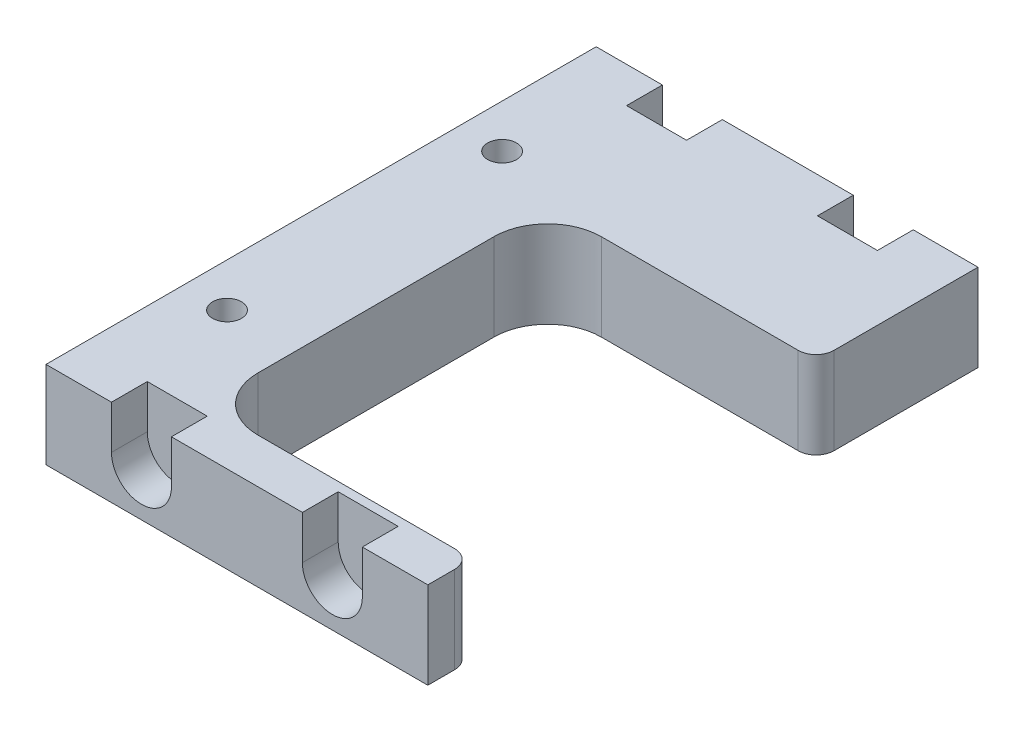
ISO-10303-21;
HEADER;
FILE_DESCRIPTION(('STEP AP214'),'2;1');
FILE_NAME('part.step','',(''),(''),'','','');
FILE_SCHEMA(('AUTOMOTIVE_DESIGN { 1 0 10303 214 1 1 1 1 }'));
ENDSEC;
DATA;
#1=APPLICATION_CONTEXT('core data for automotive mechanical design processes');
#2=APPLICATION_PROTOCOL_DEFINITION('international standard','automotive_design',2000,#1);
#3=PRODUCT_CONTEXT('',#1,'mechanical');
#4=PRODUCT('Part','Part','',(#3));
#5=PRODUCT_RELATED_PRODUCT_CATEGORY('part','',(#4));
#6=PRODUCT_DEFINITION_FORMATION('','',#4);
#7=PRODUCT_DEFINITION_CONTEXT('part definition',#1,'design');
#8=PRODUCT_DEFINITION('design','',#6,#7);
#9=PRODUCT_DEFINITION_SHAPE('','',#8);
#10=(LENGTH_UNIT() NAMED_UNIT(*) SI_UNIT(.MILLI.,.METRE.));
#11=(NAMED_UNIT(*) PLANE_ANGLE_UNIT() SI_UNIT($,.RADIAN.));
#12=(NAMED_UNIT(*) SI_UNIT($,.STERADIAN.) SOLID_ANGLE_UNIT());
#13=UNCERTAINTY_MEASURE_WITH_UNIT(LENGTH_MEASURE(1.E-05),#10,'distance_accuracy_value','');
#14=(GEOMETRIC_REPRESENTATION_CONTEXT(3) GLOBAL_UNCERTAINTY_ASSIGNED_CONTEXT((#13)) GLOBAL_UNIT_ASSIGNED_CONTEXT((#10,
#11,#12)) REPRESENTATION_CONTEXT('',''));
#15=CARTESIAN_POINT('',(0.,0.,0.));
#16=DIRECTION('',(0.,0.,1.));
#17=DIRECTION('',(1.,0.,0.));
#18=AXIS2_PLACEMENT_3D('',#15,#16,#17);
#19=CARTESIAN_POINT('',(-899.286453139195,561.091856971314,0.));
#20=DIRECTION('',(0.,1.,0.));
#21=DIRECTION('',(0.,0.,1.));
#22=AXIS2_PLACEMENT_3D('',#19,#20,#21);
#23=PLANE('',#22);
#24=CARTESIAN_POINT('',(-827.241549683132,561.091856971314,-58.559700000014));
#25=DIRECTION('',(0.,-1.,0.));
#26=DIRECTION('',(0.,0.,-1.));
#27=AXIS2_PLACEMENT_3D('',#24,#25,#26);
#28=CIRCLE('',#27,2.05000000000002);
#29=CARTESIAN_POINT('',(-827.241549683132,561.091856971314,-60.609700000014));
#30=VERTEX_POINT('',#29);
#31=EDGE_CURVE('E401',#30,#30,#28,.T.);
#32=ORIENTED_EDGE('',*,*,#31,.T.);
#33=EDGE_LOOP('',(#32));
#34=FACE_BOUND('',#33,.T.);
#35=CARTESIAN_POINT('',(-827.241549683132,561.091856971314,-19.519900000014));
#36=DIRECTION('',(0.,-1.,0.));
#37=DIRECTION('',(0.,0.,-1.));
#38=AXIS2_PLACEMENT_3D('',#35,#36,#37);
#39=CIRCLE('',#38,2.05000000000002);
#40=CARTESIAN_POINT('',(-827.241549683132,561.091856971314,-21.569900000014));
#41=VERTEX_POINT('',#40);
#42=EDGE_CURVE('E365',#41,#41,#39,.T.);
#43=ORIENTED_EDGE('',*,*,#42,.T.);
#44=EDGE_LOOP('',(#43));
#45=FACE_BOUND('',#44,.T.);
#46=DIRECTION('',(1.,0.,0.));
#47=VECTOR('',#46,1.);
#48=CARTESIAN_POINT('',(-899.286453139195,561.091856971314,0.));
#49=LINE('',#48,#47);
#50=CARTESIAN_POINT('',(-815.612059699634,561.091856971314,0.));
#51=VERTEX_POINT('',#50);
#52=CARTESIAN_POINT('',(-797.026679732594,561.091856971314,0.));
#53=VERTEX_POINT('',#52);
#54=EDGE_CURVE('E480',#51,#53,#49,.T.);
#55=ORIENTED_EDGE('',*,*,#54,.T.);
#56=DIRECTION('',(0.,0.,1.));
#57=VECTOR('',#56,1.);
#58=CARTESIAN_POINT('',(-797.026679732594,561.091856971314,-5.08));
#59=LINE('',#58,#57);
#60=CARTESIAN_POINT('',(-797.026679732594,561.091856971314,-5.08));
#61=VERTEX_POINT('',#60);
#62=EDGE_CURVE('E313',#61,#53,#59,.T.);
#63=ORIENTED_EDGE('',*,*,#62,.F.);
#64=DIRECTION('',(-1.,0.,0.));
#65=VECTOR('',#64,1.);
#66=CARTESIAN_POINT('',(0.,561.091856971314,-5.08));
#67=LINE('',#66,#65);
#68=CARTESIAN_POINT('',(-788.517679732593,561.091856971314,-5.08));
#69=VERTEX_POINT('',#68);
#70=EDGE_CURVE('E290',#69,#61,#67,.T.);
#71=ORIENTED_EDGE('',*,*,#70,.F.);
#72=DIRECTION('',(0.,0.,1.));
#73=VECTOR('',#72,1.);
#74=CARTESIAN_POINT('',(-788.517679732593,561.091856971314,-5.08));
#75=LINE('',#74,#73);
#76=CARTESIAN_POINT('',(-788.517679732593,561.091856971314,0.));
#77=VERTEX_POINT('',#76);
#78=EDGE_CURVE('E285',#69,#77,#75,.T.);
#79=ORIENTED_EDGE('',*,*,#78,.T.);
#80=CARTESIAN_POINT('',(-779.224989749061,561.091856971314,0.));
#81=VERTEX_POINT('',#80);
#82=EDGE_CURVE('E474',#77,#81,#49,.T.);
#83=ORIENTED_EDGE('',*,*,#82,.T.);
#84=DIRECTION('',(0.,0.,1.));
#85=VECTOR('',#84,1.);
#86=CARTESIAN_POINT('',(-779.224989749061,561.091856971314,0.));
#87=LINE('',#86,#85);
#88=CARTESIAN_POINT('',(-779.224989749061,561.091856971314,-3.81));
#89=VERTEX_POINT('',#88);
#90=EDGE_CURVE('E467',#89,#81,#87,.T.);
#91=ORIENTED_EDGE('',*,*,#90,.F.);
#92=CARTESIAN_POINT('',(-781.764989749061,561.091856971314,-3.81));
#93=DIRECTION('',(0.,1.,0.));
#94=DIRECTION('',(0.,0.,1.));
#95=AXIS2_PLACEMENT_3D('',#92,#93,#94);
#96=CIRCLE('',#95,2.54);
#97=CARTESIAN_POINT('',(-781.764989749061,561.091856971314,-6.35));
#98=VERTEX_POINT('',#97);
#99=EDGE_CURVE('E492',#89,#98,#96,.T.);
#100=ORIENTED_EDGE('',*,*,#99,.T.);
#101=DIRECTION('',(1.,0.,0.));
#102=VECTOR('',#101,1.);
#103=CARTESIAN_POINT('',(-899.286453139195,561.091856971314,-6.35));
#104=LINE('',#103,#102);
#105=CARTESIAN_POINT('',(-809.704989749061,561.091856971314,-6.35));
#106=VERTEX_POINT('',#105);
#107=EDGE_CURVE('E452',#106,#98,#104,.T.);
#108=ORIENTED_EDGE('',*,*,#107,.F.);
#109=CARTESIAN_POINT('',(-809.704989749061,561.091856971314,-13.97));
#110=DIRECTION('',(0.,1.,0.));
#111=DIRECTION('',(0.,0.,1.));
#112=AXIS2_PLACEMENT_3D('',#109,#110,#111);
#113=CIRCLE('',#112,7.62);
#114=CARTESIAN_POINT('',(-817.324989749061,561.091856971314,-13.97));
#115=VERTEX_POINT('',#114);
#116=EDGE_CURVE('E488',#106,#115,#113,.F.);
#117=ORIENTED_EDGE('',*,*,#116,.T.);
#118=DIRECTION('',(0.,0.,-1.));
#119=VECTOR('',#118,1.);
#120=CARTESIAN_POINT('',(-817.324989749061,561.091856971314,0.));
#121=LINE('',#120,#119);
#122=CARTESIAN_POINT('',(-817.324989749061,561.091856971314,-47.4833916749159));
#123=VERTEX_POINT('',#122);
#124=EDGE_CURVE('E448',#115,#123,#121,.T.);
#125=ORIENTED_EDGE('',*,*,#124,.T.);
#126=CARTESIAN_POINT('',(-809.704989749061,561.091856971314,-47.4833916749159));
#127=DIRECTION('',(0.,1.,0.));
#128=DIRECTION('',(0.,0.,1.));
#129=AXIS2_PLACEMENT_3D('',#126,#127,#128);
#130=CIRCLE('',#129,7.61999999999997);
#131=CARTESIAN_POINT('',(-809.704989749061,561.091856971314,-55.1033916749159));
#132=VERTEX_POINT('',#131);
#133=EDGE_CURVE('E418',#132,#123,#130,.T.);
#134=ORIENTED_EDGE('',*,*,#133,.F.);
#135=DIRECTION('',(1.,0.,0.));
#136=VECTOR('',#135,1.);
#137=CARTESIAN_POINT('',(0.,561.091856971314,-55.1033916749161));
#138=LINE('',#137,#136);
#139=CARTESIAN_POINT('',(-781.764989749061,561.091856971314,-55.1033916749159));
#140=VERTEX_POINT('',#139);
#141=EDGE_CURVE('E409',#132,#140,#138,.T.);
#142=ORIENTED_EDGE('',*,*,#141,.T.);
#143=CARTESIAN_POINT('',(-781.764989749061,561.091856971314,-57.6433916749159));
#144=DIRECTION('',(0.,1.,0.));
#145=DIRECTION('',(0.,0.,1.));
#146=AXIS2_PLACEMENT_3D('',#143,#144,#145);
#147=CIRCLE('',#146,2.53999999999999);
#148=CARTESIAN_POINT('',(-779.224989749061,561.091856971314,-57.6433916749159));
#149=VERTEX_POINT('',#148);
#150=EDGE_CURVE('E419',#140,#149,#147,.T.);
#151=ORIENTED_EDGE('',*,*,#150,.T.);
#152=CARTESIAN_POINT('',(-779.224989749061,561.091856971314,-78.0796));
#153=VERTEX_POINT('',#152);
#154=EDGE_CURVE('E468',#153,#149,#87,.T.);
#155=ORIENTED_EDGE('',*,*,#154,.F.);
#156=DIRECTION('',(-1.,0.,0.));
#157=VECTOR('',#156,1.);
#158=CARTESIAN_POINT('',(-899.286453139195,561.091856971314,-78.0796));
#159=LINE('',#158,#157);
#160=CARTESIAN_POINT('',(-788.416079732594,561.091856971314,-78.0796));
#161=VERTEX_POINT('',#160);
#162=EDGE_CURVE('E471',#153,#161,#159,.T.);
#163=ORIENTED_EDGE('',*,*,#162,.T.);
#164=DIRECTION('',(0.,0.,-1.));
#165=VECTOR('',#164,1.);
#166=CARTESIAN_POINT('',(-788.416079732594,561.091856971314,-72.9996));
#167=LINE('',#166,#165);
#168=CARTESIAN_POINT('',(-788.416079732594,561.091856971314,-72.9996));
#169=VERTEX_POINT('',#168);
#170=EDGE_CURVE('E366',#169,#161,#167,.T.);
#171=ORIENTED_EDGE('',*,*,#170,.F.);
#172=DIRECTION('',(1.,0.,0.));
#173=VECTOR('',#172,1.);
#174=CARTESIAN_POINT('',(0.,561.091856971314,-72.9996));
#175=LINE('',#174,#173);
#176=CARTESIAN_POINT('',(-796.925079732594,561.091856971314,-72.9996));
#177=VERTEX_POINT('',#176);
#178=EDGE_CURVE('E347',#177,#169,#175,.T.);
#179=ORIENTED_EDGE('',*,*,#178,.F.);
#180=DIRECTION('',(0.,0.,-1.));
#181=VECTOR('',#180,1.);
#182=CARTESIAN_POINT('',(-796.925079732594,561.091856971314,-72.9996));
#183=LINE('',#182,#181);
#184=CARTESIAN_POINT('',(-796.925079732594,561.091856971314,-78.0796));
#185=VERTEX_POINT('',#184);
#186=EDGE_CURVE('E368',#177,#185,#183,.T.);
#187=ORIENTED_EDGE('',*,*,#186,.T.);
#188=CARTESIAN_POINT('',(-815.510459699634,561.091856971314,-78.0796));
#189=VERTEX_POINT('',#188);
#190=EDGE_CURVE('E475',#185,#189,#159,.T.);
#191=ORIENTED_EDGE('',*,*,#190,.T.);
#192=DIRECTION('',(0.,0.,-1.));
#193=VECTOR('',#192,1.);
#194=CARTESIAN_POINT('',(-815.510459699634,561.091856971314,-72.9996));
#195=LINE('',#194,#193);
#196=CARTESIAN_POINT('',(-815.510459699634,561.091856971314,-72.9996));
#197=VERTEX_POINT('',#196);
#198=EDGE_CURVE('E394',#197,#189,#195,.T.);
#199=ORIENTED_EDGE('',*,*,#198,.F.);
#200=DIRECTION('',(1.,0.,0.));
#201=VECTOR('',#200,1.);
#202=CARTESIAN_POINT('',(0.,561.091856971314,-72.9996));
#203=LINE('',#202,#201);
#204=CARTESIAN_POINT('',(-824.019459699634,561.091856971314,-72.9996));
#205=VERTEX_POINT('',#204);
#206=EDGE_CURVE('E379',#205,#197,#203,.T.);
#207=ORIENTED_EDGE('',*,*,#206,.F.);
#208=DIRECTION('',(0.,0.,-1.));
#209=VECTOR('',#208,1.);
#210=CARTESIAN_POINT('',(-824.019459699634,561.091856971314,-72.9996));
#211=LINE('',#210,#209);
#212=CARTESIAN_POINT('',(-824.019459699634,561.091856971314,-78.0796));
#213=VERTEX_POINT('',#212);
#214=EDGE_CURVE('E396',#205,#213,#211,.T.);
#215=ORIENTED_EDGE('',*,*,#214,.T.);
#216=CARTESIAN_POINT('',(-833.413749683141,561.091856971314,-78.0796));
#217=VERTEX_POINT('',#216);
#218=EDGE_CURVE('E470',#213,#217,#159,.T.);
#219=ORIENTED_EDGE('',*,*,#218,.T.);
#220=DIRECTION('',(0.,0.,-1.));
#221=VECTOR('',#220,1.);
#222=CARTESIAN_POINT('',(-833.413749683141,561.091856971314,0.));
#223=LINE('',#222,#221);
#224=CARTESIAN_POINT('',(-833.413749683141,561.091856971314,0.));
#225=VERTEX_POINT('',#224);
#226=EDGE_CURVE('E404',#225,#217,#223,.T.);
#227=ORIENTED_EDGE('',*,*,#226,.F.);
#228=CARTESIAN_POINT('',(-824.121059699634,561.091856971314,0.));
#229=VERTEX_POINT('',#228);
#230=EDGE_CURVE('E476',#225,#229,#49,.T.);
#231=ORIENTED_EDGE('',*,*,#230,.T.);
#232=DIRECTION('',(0.,0.,1.));
#233=VECTOR('',#232,1.);
#234=CARTESIAN_POINT('',(-824.121059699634,561.091856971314,-5.08));
#235=LINE('',#234,#233);
#236=CARTESIAN_POINT('',(-824.121059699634,561.091856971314,-5.08));
#237=VERTEX_POINT('',#236);
#238=EDGE_CURVE('E335',#237,#229,#235,.T.);
#239=ORIENTED_EDGE('',*,*,#238,.F.);
#240=DIRECTION('',(-1.,0.,0.));
#241=VECTOR('',#240,1.);
#242=CARTESIAN_POINT('',(0.,561.091856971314,-5.08));
#243=LINE('',#242,#241);
#244=CARTESIAN_POINT('',(-815.612059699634,561.091856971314,-5.08));
#245=VERTEX_POINT('',#244);
#246=EDGE_CURVE('E322',#245,#237,#243,.T.);
#247=ORIENTED_EDGE('',*,*,#246,.F.);
#248=DIRECTION('',(0.,0.,1.));
#249=VECTOR('',#248,1.);
#250=CARTESIAN_POINT('',(-815.612059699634,561.091856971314,-5.08));
#251=LINE('',#250,#249);
#252=EDGE_CURVE('E337',#245,#51,#251,.T.);
#253=ORIENTED_EDGE('',*,*,#252,.T.);
#254=EDGE_LOOP('',(#55,#63,#71,#79,#83,#91,#100,#108,#117,#125,#134,#142,#151,#155,#163,#171,
#179,#187,#191,#199,#207,#215,#219,#227,#231,#239,#247,#253));
#255=FACE_BOUND('',#254,.T.);
#256=ADVANCED_FACE('F91',(#34,#45,#255),#23,.T.);
#257=CARTESIAN_POINT('',(0.,0.,0.));
#258=DIRECTION('',(0.,0.,1.));
#259=DIRECTION('',(1.,0.,0.));
#260=AXIS2_PLACEMENT_3D('',#257,#258,#259);
#261=PLANE('',#260);
#262=CARTESIAN_POINT('',(-792.772179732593,554.919656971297,0.));
#263=DIRECTION('',(0.,0.,1.));
#264=DIRECTION('',(1.,0.,0.));
#265=AXIS2_PLACEMENT_3D('',#262,#263,#264);
#266=CIRCLE('',#265,4.25450000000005);
#267=CARTESIAN_POINT('',(-788.517679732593,554.919656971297,0.));
#268=VERTEX_POINT('',#267);
#269=CARTESIAN_POINT('',(-797.026679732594,554.919656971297,0.));
#270=VERTEX_POINT('',#269);
#271=EDGE_CURVE('E107',#268,#270,#266,.F.);
#272=ORIENTED_EDGE('',*,*,#271,.T.);
#273=DIRECTION('',(0.,1.,0.));
#274=VECTOR('',#273,1.);
#275=CARTESIAN_POINT('',(-797.026679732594,0.,0.));
#276=LINE('',#275,#274);
#277=EDGE_CURVE('E299',#270,#53,#276,.T.);
#278=ORIENTED_EDGE('',*,*,#277,.T.);
#279=ORIENTED_EDGE('',*,*,#54,.F.);
#280=DIRECTION('',(0.,-1.,0.));
#281=VECTOR('',#280,1.);
#282=CARTESIAN_POINT('',(-815.612059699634,0.,0.));
#283=LINE('',#282,#281);
#284=CARTESIAN_POINT('',(-815.612059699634,554.919656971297,0.));
#285=VERTEX_POINT('',#284);
#286=EDGE_CURVE('E329',#51,#285,#283,.T.);
#287=ORIENTED_EDGE('',*,*,#286,.T.);
#288=CARTESIAN_POINT('',(-819.866559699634,554.919656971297,0.));
#289=DIRECTION('',(0.,0.,1.));
#290=DIRECTION('',(1.,0.,0.));
#291=AXIS2_PLACEMENT_3D('',#288,#289,#290);
#292=CIRCLE('',#291,4.25450000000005);
#293=CARTESIAN_POINT('',(-824.121059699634,554.919656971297,0.));
#294=VERTEX_POINT('',#293);
#295=EDGE_CURVE('E115',#285,#294,#292,.F.);
#296=ORIENTED_EDGE('',*,*,#295,.T.);
#297=DIRECTION('',(0.,1.,0.));
#298=VECTOR('',#297,1.);
#299=CARTESIAN_POINT('',(-824.121059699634,0.,0.));
#300=LINE('',#299,#298);
#301=EDGE_CURVE('E320',#294,#229,#300,.T.);
#302=ORIENTED_EDGE('',*,*,#301,.T.);
#303=ORIENTED_EDGE('',*,*,#230,.F.);
#304=DIRECTION('',(0.,1.,0.));
#305=VECTOR('',#304,1.);
#306=CARTESIAN_POINT('',(-833.413749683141,0.,0.));
#307=LINE('',#306,#305);
#308=CARTESIAN_POINT('',(-833.413749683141,548.747456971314,0.));
#309=VERTEX_POINT('',#308);
#310=EDGE_CURVE('E423',#309,#225,#307,.T.);
#311=ORIENTED_EDGE('',*,*,#310,.F.);
#312=DIRECTION('',(-1.,0.,0.));
#313=VECTOR('',#312,1.);
#314=CARTESIAN_POINT('',(0.,548.747456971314,0.));
#315=LINE('',#314,#313);
#316=CARTESIAN_POINT('',(-779.224989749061,548.747456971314,0.));
#317=VERTEX_POINT('',#316);
#318=EDGE_CURVE('E439',#317,#309,#315,.T.);
#319=ORIENTED_EDGE('',*,*,#318,.F.);
#320=DIRECTION('',(0.,-1.,0.));
#321=VECTOR('',#320,1.);
#322=CARTESIAN_POINT('',(-779.224989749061,0.,0.));
#323=LINE('',#322,#321);
#324=EDGE_CURVE('E456',#81,#317,#323,.T.);
#325=ORIENTED_EDGE('',*,*,#324,.F.);
#326=ORIENTED_EDGE('',*,*,#82,.F.);
#327=DIRECTION('',(0.,-1.,0.));
#328=VECTOR('',#327,1.);
#329=CARTESIAN_POINT('',(-788.517679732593,0.,0.));
#330=LINE('',#329,#328);
#331=EDGE_CURVE('E302',#77,#268,#330,.T.);
#332=ORIENTED_EDGE('',*,*,#331,.T.);
#333=EDGE_LOOP('',(#272,#278,#279,#287,#296,#302,#303,#311,#319,#325,#326,#332));
#334=FACE_BOUND('',#333,.T.);
#335=ADVANCED_FACE('F524',(#334),#261,.T.);
#336=CARTESIAN_POINT('',(0.,0.,-78.0796));
#337=DIRECTION('',(0.,0.,-1.));
#338=DIRECTION('',(-1.,0.,0.));
#339=AXIS2_PLACEMENT_3D('',#336,#337,#338);
#340=PLANE('',#339);
#341=CARTESIAN_POINT('',(-792.670579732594,554.919656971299,-78.0796));
#342=DIRECTION('',(0.,0.,-1.));
#343=DIRECTION('',(-1.,0.,0.));
#344=AXIS2_PLACEMENT_3D('',#341,#342,#343);
#345=CIRCLE('',#344,4.25450000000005);
#346=CARTESIAN_POINT('',(-796.925079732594,554.919656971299,-78.0796));
#347=VERTEX_POINT('',#346);
#348=CARTESIAN_POINT('',(-788.416079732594,554.919656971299,-78.0796));
#349=VERTEX_POINT('',#348);
#350=EDGE_CURVE('E353',#347,#349,#345,.F.);
#351=ORIENTED_EDGE('',*,*,#350,.T.);
#352=DIRECTION('',(0.,1.,0.));
#353=VECTOR('',#352,1.);
#354=CARTESIAN_POINT('',(-788.416079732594,0.,-78.0796));
#355=LINE('',#354,#353);
#356=EDGE_CURVE('E345',#349,#161,#355,.T.);
#357=ORIENTED_EDGE('',*,*,#356,.T.);
#358=ORIENTED_EDGE('',*,*,#162,.F.);
#359=DIRECTION('',(0.,-1.,0.));
#360=VECTOR('',#359,1.);
#361=CARTESIAN_POINT('',(-779.224989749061,562.158656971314,-78.0796));
#362=LINE('',#361,#360);
#363=CARTESIAN_POINT('',(-779.224989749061,548.747456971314,-78.0796));
#364=VERTEX_POINT('',#363);
#365=EDGE_CURVE('E455',#153,#364,#362,.T.);
#366=ORIENTED_EDGE('',*,*,#365,.T.);
#367=DIRECTION('',(1.,0.,0.));
#368=VECTOR('',#367,1.);
#369=CARTESIAN_POINT('',(0.,548.747456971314,-78.0796));
#370=LINE('',#369,#368);
#371=CARTESIAN_POINT('',(-833.413749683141,548.747456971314,-78.0796));
#372=VERTEX_POINT('',#371);
#373=EDGE_CURVE('E438',#372,#364,#370,.T.);
#374=ORIENTED_EDGE('',*,*,#373,.F.);
#375=DIRECTION('',(0.,-1.,0.));
#376=VECTOR('',#375,1.);
#377=CARTESIAN_POINT('',(-833.413749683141,0.,-78.0796));
#378=LINE('',#377,#376);
#379=EDGE_CURVE('E435',#217,#372,#378,.T.);
#380=ORIENTED_EDGE('',*,*,#379,.F.);
#381=ORIENTED_EDGE('',*,*,#218,.F.);
#382=DIRECTION('',(0.,-1.,0.));
#383=VECTOR('',#382,1.);
#384=CARTESIAN_POINT('',(-824.019459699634,0.,-78.0796));
#385=LINE('',#384,#383);
#386=CARTESIAN_POINT('',(-824.019459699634,554.919656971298,-78.0796));
#387=VERTEX_POINT('',#386);
#388=EDGE_CURVE('E387',#213,#387,#385,.T.);
#389=ORIENTED_EDGE('',*,*,#388,.T.);
#390=CARTESIAN_POINT('',(-819.764959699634,554.919656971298,-78.0796));
#391=DIRECTION('',(0.,0.,-1.));
#392=DIRECTION('',(-1.,0.,0.));
#393=AXIS2_PLACEMENT_3D('',#390,#391,#392);
#394=CIRCLE('',#393,4.25450000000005);
#395=CARTESIAN_POINT('',(-815.510459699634,554.919656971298,-78.0796));
#396=VERTEX_POINT('',#395);
#397=EDGE_CURVE('E312',#387,#396,#394,.F.);
#398=ORIENTED_EDGE('',*,*,#397,.T.);
#399=DIRECTION('',(0.,1.,0.));
#400=VECTOR('',#399,1.);
#401=CARTESIAN_POINT('',(-815.510459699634,0.,-78.0796));
#402=LINE('',#401,#400);
#403=EDGE_CURVE('E377',#396,#189,#402,.T.);
#404=ORIENTED_EDGE('',*,*,#403,.T.);
#405=ORIENTED_EDGE('',*,*,#190,.F.);
#406=DIRECTION('',(0.,-1.,0.));
#407=VECTOR('',#406,1.);
#408=CARTESIAN_POINT('',(-796.925079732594,0.,-78.0796));
#409=LINE('',#408,#407);
#410=EDGE_CURVE('E356',#185,#347,#409,.T.);
#411=ORIENTED_EDGE('',*,*,#410,.T.);
#412=EDGE_LOOP('',(#351,#357,#358,#366,#374,#380,#381,#389,#398,#404,#405,#411));
#413=FACE_BOUND('',#412,.T.);
#414=ADVANCED_FACE('F585',(#413),#340,.T.);
#415=CARTESIAN_POINT('',(-817.324989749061,637.016869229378,0.));
#416=DIRECTION('',(1.,0.,0.));
#417=DIRECTION('',(0.,0.,-1.));
#418=AXIS2_PLACEMENT_3D('',#415,#416,#417);
#419=PLANE('',#418);
#420=DIRECTION('',(0.,0.,1.));
#421=VECTOR('',#420,1.);
#422=CARTESIAN_POINT('',(-817.324989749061,548.747456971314,0.));
#423=LINE('',#422,#421);
#424=CARTESIAN_POINT('',(-817.324989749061,548.747456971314,-47.4833916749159));
#425=VERTEX_POINT('',#424);
#426=CARTESIAN_POINT('',(-817.324989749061,548.747456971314,-13.97));
#427=VERTEX_POINT('',#426);
#428=EDGE_CURVE('E446',#425,#427,#423,.T.);
#429=ORIENTED_EDGE('',*,*,#428,.F.);
#430=DIRECTION('',(0.,-1.,0.));
#431=VECTOR('',#430,1.);
#432=CARTESIAN_POINT('',(-817.324989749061,607.665572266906,-47.4833916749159));
#433=LINE('',#432,#431);
#434=EDGE_CURVE('E425',#123,#425,#433,.T.);
#435=ORIENTED_EDGE('',*,*,#434,.F.);
#436=ORIENTED_EDGE('',*,*,#124,.F.);
#437=DIRECTION('',(0.,-1.,0.));
#438=VECTOR('',#437,1.);
#439=CARTESIAN_POINT('',(-817.324989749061,637.016869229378,-13.97));
#440=LINE('',#439,#438);
#441=EDGE_CURVE('E479',#115,#427,#440,.T.);
#442=ORIENTED_EDGE('',*,*,#441,.T.);
#443=EDGE_LOOP('',(#429,#435,#436,#442));
#444=FACE_BOUND('',#443,.T.);
#445=ADVANCED_FACE('F564',(#444),#419,.T.);
#446=CARTESIAN_POINT('',(-833.413749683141,0.,0.));
#447=DIRECTION('',(-1.,0.,0.));
#448=DIRECTION('',(0.,0.,1.));
#449=AXIS2_PLACEMENT_3D('',#446,#447,#448);
#450=PLANE('',#449);
#451=ORIENTED_EDGE('',*,*,#310,.T.);
#452=ORIENTED_EDGE('',*,*,#226,.T.);
#453=ORIENTED_EDGE('',*,*,#379,.T.);
#454=DIRECTION('',(0.,0.,1.));
#455=VECTOR('',#454,1.);
#456=CARTESIAN_POINT('',(-833.413749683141,548.747456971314,-84.4296));
#457=LINE('',#456,#455);
#458=EDGE_CURVE('E459',#372,#309,#457,.T.);
#459=ORIENTED_EDGE('',*,*,#458,.T.);
#460=EDGE_LOOP('',(#451,#452,#453,#459));
#461=FACE_BOUND('',#460,.T.);
#462=ADVANCED_FACE('F588',(#461),#450,.T.);
#463=CARTESIAN_POINT('',(0.,548.747456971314,0.));
#464=DIRECTION('',(0.,-1.,0.));
#465=DIRECTION('',(0.,0.,-1.));
#466=AXIS2_PLACEMENT_3D('',#463,#464,#465);
#467=PLANE('',#466);
#468=CARTESIAN_POINT('',(-827.241549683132,548.747456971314,-58.559700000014));
#469=DIRECTION('',(0.,-1.,0.));
#470=DIRECTION('',(0.,0.,-1.));
#471=AXIS2_PLACEMENT_3D('',#468,#469,#470);
#472=CIRCLE('',#471,3.31999999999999);
#473=CARTESIAN_POINT('',(-827.241549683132,548.747456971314,-61.8797000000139));
#474=VERTEX_POINT('',#473);
#475=EDGE_CURVE('E100',#474,#474,#472,.F.);
#476=ORIENTED_EDGE('',*,*,#475,.T.);
#477=EDGE_LOOP('',(#476));
#478=FACE_BOUND('',#477,.T.);
#479=CARTESIAN_POINT('',(-827.241549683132,548.747456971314,-19.519900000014));
#480=DIRECTION('',(0.,-1.,0.));
#481=DIRECTION('',(0.,0.,-1.));
#482=AXIS2_PLACEMENT_3D('',#479,#480,#481);
#483=CIRCLE('',#482,3.31999999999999);
#484=CARTESIAN_POINT('',(-827.241549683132,548.747456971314,-22.8399000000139));
#485=VERTEX_POINT('',#484);
#486=EDGE_CURVE('E502',#485,#485,#483,.F.);
#487=ORIENTED_EDGE('',*,*,#486,.T.);
#488=EDGE_LOOP('',(#487));
#489=FACE_BOUND('',#488,.T.);
#490=CARTESIAN_POINT('',(-809.704989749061,548.747456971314,-47.4833916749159));
#491=DIRECTION('',(0.,-1.,0.));
#492=DIRECTION('',(0.,0.,-1.));
#493=AXIS2_PLACEMENT_3D('',#490,#491,#492);
#494=CIRCLE('',#493,7.61999999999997);
#495=CARTESIAN_POINT('',(-809.704989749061,548.747456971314,-55.1033916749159));
#496=VERTEX_POINT('',#495);
#497=EDGE_CURVE('E415',#496,#425,#494,.F.);
#498=ORIENTED_EDGE('',*,*,#497,.T.);
#499=ORIENTED_EDGE('',*,*,#428,.T.);
#500=CARTESIAN_POINT('',(-809.704989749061,548.747456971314,-13.97));
#501=DIRECTION('',(0.,-1.,0.));
#502=DIRECTION('',(0.,0.,-1.));
#503=AXIS2_PLACEMENT_3D('',#500,#501,#502);
#504=CIRCLE('',#503,7.62);
#505=CARTESIAN_POINT('',(-809.704989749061,548.747456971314,-6.35));
#506=VERTEX_POINT('',#505);
#507=EDGE_CURVE('E485',#427,#506,#504,.F.);
#508=ORIENTED_EDGE('',*,*,#507,.T.);
#509=DIRECTION('',(-1.,0.,0.));
#510=VECTOR('',#509,1.);
#511=CARTESIAN_POINT('',(0.,548.747456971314,-6.35));
#512=LINE('',#511,#510);
#513=CARTESIAN_POINT('',(-781.764989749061,548.747456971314,-6.35));
#514=VERTEX_POINT('',#513);
#515=EDGE_CURVE('E442',#514,#506,#512,.T.);
#516=ORIENTED_EDGE('',*,*,#515,.F.);
#517=CARTESIAN_POINT('',(-781.764989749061,548.747456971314,-3.81));
#518=DIRECTION('',(0.,-1.,0.));
#519=DIRECTION('',(0.,0.,-1.));
#520=AXIS2_PLACEMENT_3D('',#517,#518,#519);
#521=CIRCLE('',#520,2.54);
#522=CARTESIAN_POINT('',(-779.224989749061,548.747456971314,-3.80999999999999));
#523=VERTEX_POINT('',#522);
#524=EDGE_CURVE('E490',#514,#523,#521,.T.);
#525=ORIENTED_EDGE('',*,*,#524,.T.);
#526=DIRECTION('',(0.,0.,1.));
#527=VECTOR('',#526,1.);
#528=CARTESIAN_POINT('',(-779.224989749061,548.747456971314,-84.4296));
#529=LINE('',#528,#527);
#530=EDGE_CURVE('E464',#523,#317,#529,.T.);
#531=ORIENTED_EDGE('',*,*,#530,.T.);
#532=ORIENTED_EDGE('',*,*,#318,.T.);
#533=ORIENTED_EDGE('',*,*,#458,.F.);
#534=ORIENTED_EDGE('',*,*,#373,.T.);
#535=CARTESIAN_POINT('',(-779.224989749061,548.747456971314,-57.6433916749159));
#536=VERTEX_POINT('',#535);
#537=EDGE_CURVE('E465',#364,#536,#529,.T.);
#538=ORIENTED_EDGE('',*,*,#537,.T.);
#539=CARTESIAN_POINT('',(-781.764989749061,548.747456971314,-57.6433916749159));
#540=DIRECTION('',(0.,-1.,0.));
#541=DIRECTION('',(0.,0.,-1.));
#542=AXIS2_PLACEMENT_3D('',#539,#540,#541);
#543=CIRCLE('',#542,2.53999999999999);
#544=CARTESIAN_POINT('',(-781.764989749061,548.747456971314,-55.1033916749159));
#545=VERTEX_POINT('',#544);
#546=EDGE_CURVE('E410',#545,#536,#543,.F.);
#547=ORIENTED_EDGE('',*,*,#546,.F.);
#548=DIRECTION('',(1.,0.,0.));
#549=VECTOR('',#548,1.);
#550=CARTESIAN_POINT('',(0.,548.747456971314,-55.1033916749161));
#551=LINE('',#550,#549);
#552=EDGE_CURVE('E420',#496,#545,#551,.T.);
#553=ORIENTED_EDGE('',*,*,#552,.F.);
#554=EDGE_LOOP('',(#498,#499,#508,#516,#525,#531,#532,#533,#534,#538,#547,#553));
#555=FACE_BOUND('',#554,.T.);
#556=ADVANCED_FACE('F507',(#478,#489,#555),#467,.T.);
#557=CARTESIAN_POINT('',(-779.224989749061,0.,6.35));
#558=DIRECTION('',(1.,0.,0.));
#559=DIRECTION('',(0.,0.,-1.));
#560=AXIS2_PLACEMENT_3D('',#557,#558,#559);
#561=PLANE('',#560);
#562=ORIENTED_EDGE('',*,*,#324,.T.);
#563=ORIENTED_EDGE('',*,*,#530,.F.);
#564=DIRECTION('',(0.,-1.,0.));
#565=VECTOR('',#564,1.);
#566=CARTESIAN_POINT('',(-779.224989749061,561.091856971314,-3.81));
#567=LINE('',#566,#565);
#568=EDGE_CURVE('E497',#523,#89,#567,.F.);
#569=ORIENTED_EDGE('',*,*,#568,.T.);
#570=ORIENTED_EDGE('',*,*,#90,.T.);
#571=EDGE_LOOP('',(#562,#563,#569,#570));
#572=FACE_BOUND('',#571,.T.);
#573=ADVANCED_FACE('F539',(#572),#561,.T.);
#574=ORIENTED_EDGE('',*,*,#537,.F.);
#575=ORIENTED_EDGE('',*,*,#365,.F.);
#576=ORIENTED_EDGE('',*,*,#154,.T.);
#577=DIRECTION('',(0.,-1.,0.));
#578=VECTOR('',#577,1.);
#579=CARTESIAN_POINT('',(-779.224989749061,607.665572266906,-57.6433916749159));
#580=LINE('',#579,#578);
#581=EDGE_CURVE('E430',#149,#536,#580,.T.);
#582=ORIENTED_EDGE('',*,*,#581,.T.);
#583=EDGE_LOOP('',(#574,#575,#576,#582));
#584=FACE_BOUND('',#583,.T.);
#585=ADVANCED_FACE('F582',(#584),#561,.T.);
#586=CARTESIAN_POINT('',(0.,637.016869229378,-6.35));
#587=DIRECTION('',(0.,0.,1.));
#588=DIRECTION('',(1.,0.,0.));
#589=AXIS2_PLACEMENT_3D('',#586,#587,#588);
#590=PLANE('',#589);
#591=ORIENTED_EDGE('',*,*,#107,.T.);
#592=DIRECTION('',(0.,-1.,0.));
#593=VECTOR('',#592,1.);
#594=CARTESIAN_POINT('',(-781.764989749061,548.747456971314,-6.35));
#595=LINE('',#594,#593);
#596=EDGE_CURVE('E494',#98,#514,#595,.T.);
#597=ORIENTED_EDGE('',*,*,#596,.T.);
#598=ORIENTED_EDGE('',*,*,#515,.T.);
#599=DIRECTION('',(0.,-1.,0.));
#600=VECTOR('',#599,1.);
#601=CARTESIAN_POINT('',(-809.704989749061,637.016869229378,-6.35));
#602=LINE('',#601,#600);
#603=EDGE_CURVE('E483',#506,#106,#602,.F.);
#604=ORIENTED_EDGE('',*,*,#603,.T.);
#605=EDGE_LOOP('',(#591,#597,#598,#604));
#606=FACE_BOUND('',#605,.T.);
#607=ADVANCED_FACE('F554',(#606),#590,.F.);
#608=CARTESIAN_POINT('',(-809.704989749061,637.016869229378,-13.97));
#609=DIRECTION('',(0.,-1.,0.));
#610=DIRECTION('',(0.,0.,-1.));
#611=AXIS2_PLACEMENT_3D('',#608,#609,#610);
#612=CYLINDRICAL_SURFACE('',#611,7.62);
#613=ORIENTED_EDGE('',*,*,#116,.F.);
#614=ORIENTED_EDGE('',*,*,#603,.F.);
#615=ORIENTED_EDGE('',*,*,#507,.F.);
#616=ORIENTED_EDGE('',*,*,#441,.F.);
#617=EDGE_LOOP('',(#613,#614,#615,#616));
#618=FACE_BOUND('',#617,.T.);
#619=ADVANCED_FACE('F558',(#618),#612,.F.);
#620=CARTESIAN_POINT('',(-781.764989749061,637.016869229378,-3.81));
#621=DIRECTION('',(0.,1.,0.));
#622=DIRECTION('',(0.,0.,1.));
#623=AXIS2_PLACEMENT_3D('',#620,#621,#622);
#624=CYLINDRICAL_SURFACE('',#623,2.54);
#625=ORIENTED_EDGE('',*,*,#99,.F.);
#626=ORIENTED_EDGE('',*,*,#568,.F.);
#627=ORIENTED_EDGE('',*,*,#524,.F.);
#628=ORIENTED_EDGE('',*,*,#596,.F.);
#629=EDGE_LOOP('',(#625,#626,#627,#628));
#630=FACE_BOUND('',#629,.T.);
#631=ADVANCED_FACE('F549',(#630),#624,.T.);
#632=CARTESIAN_POINT('',(-809.704989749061,607.665572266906,-47.4833916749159));
#633=DIRECTION('',(0.,-1.,0.));
#634=DIRECTION('',(0.,0.,-1.));
#635=AXIS2_PLACEMENT_3D('',#632,#633,#634);
#636=CYLINDRICAL_SURFACE('',#635,7.61999999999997);
#637=DIRECTION('',(0.,-1.,0.));
#638=VECTOR('',#637,1.);
#639=CARTESIAN_POINT('',(-809.704989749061,607.665572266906,-55.1033916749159));
#640=LINE('',#639,#638);
#641=EDGE_CURVE('E413',#132,#496,#640,.T.);
#642=ORIENTED_EDGE('',*,*,#641,.F.);
#643=ORIENTED_EDGE('',*,*,#133,.T.);
#644=ORIENTED_EDGE('',*,*,#434,.T.);
#645=ORIENTED_EDGE('',*,*,#497,.F.);
#646=EDGE_LOOP('',(#642,#643,#644,#645));
#647=FACE_BOUND('',#646,.T.);
#648=ADVANCED_FACE('F568',(#647),#636,.F.);
#649=CARTESIAN_POINT('',(-781.764989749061,607.665572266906,-57.6433916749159));
#650=DIRECTION('',(0.,-1.,0.));
#651=DIRECTION('',(0.,0.,-1.));
#652=AXIS2_PLACEMENT_3D('',#649,#650,#651);
#653=CYLINDRICAL_SURFACE('',#652,2.53999999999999);
#654=ORIENTED_EDGE('',*,*,#150,.F.);
#655=DIRECTION('',(0.,-1.,0.));
#656=VECTOR('',#655,1.);
#657=CARTESIAN_POINT('',(-781.764989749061,607.665572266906,-55.1033916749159));
#658=LINE('',#657,#656);
#659=EDGE_CURVE('E414',#140,#545,#658,.T.);
#660=ORIENTED_EDGE('',*,*,#659,.T.);
#661=ORIENTED_EDGE('',*,*,#546,.T.);
#662=ORIENTED_EDGE('',*,*,#581,.F.);
#663=EDGE_LOOP('',(#654,#660,#661,#662));
#664=FACE_BOUND('',#663,.T.);
#665=ADVANCED_FACE('F579',(#664),#653,.T.);
#666=CARTESIAN_POINT('',(0.,607.665572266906,-55.1033916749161));
#667=DIRECTION('',(0.,0.,-1.));
#668=DIRECTION('',(-1.,0.,0.));
#669=AXIS2_PLACEMENT_3D('',#666,#667,#668);
#670=PLANE('',#669);
#671=ORIENTED_EDGE('',*,*,#141,.F.);
#672=ORIENTED_EDGE('',*,*,#641,.T.);
#673=ORIENTED_EDGE('',*,*,#552,.T.);
#674=ORIENTED_EDGE('',*,*,#659,.F.);
#675=EDGE_LOOP('',(#671,#672,#673,#674));
#676=FACE_BOUND('',#675,.T.);
#677=ADVANCED_FACE('F574',(#676),#670,.F.);
#678=CARTESIAN_POINT('',(-827.241549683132,561.091856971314,-19.519900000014));
#679=DIRECTION('',(0.,-1.,0.));
#680=DIRECTION('',(0.,0.,-1.));
#681=AXIS2_PLACEMENT_3D('',#678,#679,#680);
#682=CYLINDRICAL_SURFACE('',#681,2.05000000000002);
#683=CARTESIAN_POINT('',(-827.241549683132,550.017456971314,-19.519900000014));
#684=DIRECTION('',(0.,-1.,0.));
#685=DIRECTION('',(0.,0.,-1.));
#686=AXIS2_PLACEMENT_3D('',#683,#684,#685);
#687=CIRCLE('',#686,2.05000000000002);
#688=CARTESIAN_POINT('',(-827.241549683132,550.017456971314,-21.569900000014));
#689=VERTEX_POINT('',#688);
#690=EDGE_CURVE('E12',#689,#689,#687,.T.);
#691=ORIENTED_EDGE('',*,*,#690,.T.);
#692=EDGE_LOOP('',(#691));
#693=FACE_BOUND('',#692,.T.);
#694=ORIENTED_EDGE('',*,*,#42,.F.);
#695=EDGE_LOOP('',(#694));
#696=FACE_BOUND('',#695,.T.);
#697=ADVANCED_FACE('F518',(#693,#696),#682,.F.);
#698=CARTESIAN_POINT('',(-827.241549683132,561.091856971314,-58.559700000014));
#699=DIRECTION('',(0.,-1.,0.));
#700=DIRECTION('',(0.,0.,-1.));
#701=AXIS2_PLACEMENT_3D('',#698,#699,#700);
#702=CYLINDRICAL_SURFACE('',#701,2.05000000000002);
#703=CARTESIAN_POINT('',(-827.241549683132,550.017456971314,-58.559700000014));
#704=DIRECTION('',(0.,-1.,0.));
#705=DIRECTION('',(0.,0.,-1.));
#706=AXIS2_PLACEMENT_3D('',#703,#704,#705);
#707=CIRCLE('',#706,2.05000000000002);
#708=CARTESIAN_POINT('',(-827.241549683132,550.017456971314,-60.609700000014));
#709=VERTEX_POINT('',#708);
#710=EDGE_CURVE('E499',#709,#709,#707,.T.);
#711=ORIENTED_EDGE('',*,*,#710,.T.);
#712=EDGE_LOOP('',(#711));
#713=FACE_BOUND('',#712,.T.);
#714=ORIENTED_EDGE('',*,*,#31,.F.);
#715=EDGE_LOOP('',(#714));
#716=FACE_BOUND('',#715,.T.);
#717=ADVANCED_FACE('F513',(#713,#716),#702,.F.);
#718=CARTESIAN_POINT('',(-827.241549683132,550.017456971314,-58.559700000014));
#719=DIRECTION('',(0.,-1.,0.));
#720=DIRECTION('',(0.,0.,-1.));
#721=AXIS2_PLACEMENT_3D('',#718,#719,#720);
#722=CONICAL_SURFACE('',#721,2.05000000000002,0.785398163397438);
#723=ORIENTED_EDGE('',*,*,#475,.F.);
#724=EDGE_LOOP('',(#723));
#725=FACE_BOUND('',#724,.T.);
#726=ORIENTED_EDGE('',*,*,#710,.F.);
#727=EDGE_LOOP('',(#726));
#728=FACE_BOUND('',#727,.T.);
#729=ADVANCED_FACE('F510',(#725,#728),#722,.F.);
#730=CARTESIAN_POINT('',(-827.241549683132,550.017456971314,-19.519900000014));
#731=DIRECTION('',(0.,-1.,0.));
#732=DIRECTION('',(0.,0.,-1.));
#733=AXIS2_PLACEMENT_3D('',#730,#731,#732);
#734=CONICAL_SURFACE('',#733,2.05000000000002,0.785398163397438);
#735=ORIENTED_EDGE('',*,*,#486,.F.);
#736=EDGE_LOOP('',(#735));
#737=FACE_BOUND('',#736,.T.);
#738=ORIENTED_EDGE('',*,*,#690,.F.);
#739=EDGE_LOOP('',(#738));
#740=FACE_BOUND('',#739,.T.);
#741=ADVANCED_FACE('F94',(#737,#740),#734,.F.);
#742=CARTESIAN_POINT('',(-819.764959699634,554.919656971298,-72.9996));
#743=DIRECTION('',(0.,0.,-1.));
#744=DIRECTION('',(-1.,0.,0.));
#745=AXIS2_PLACEMENT_3D('',#742,#743,#744);
#746=CYLINDRICAL_SURFACE('',#745,4.25450000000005);
#747=ORIENTED_EDGE('',*,*,#397,.F.);
#748=DIRECTION('',(0.,0.,-1.));
#749=VECTOR('',#748,1.);
#750=CARTESIAN_POINT('',(-824.019459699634,554.919656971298,-72.9996));
#751=LINE('',#750,#749);
#752=CARTESIAN_POINT('',(-824.019459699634,554.919656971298,-72.9996));
#753=VERTEX_POINT('',#752);
#754=EDGE_CURVE('E384',#753,#387,#751,.T.);
#755=ORIENTED_EDGE('',*,*,#754,.F.);
#756=CARTESIAN_POINT('',(-819.764959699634,554.919656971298,-72.9996));
#757=DIRECTION('',(0.,0.,-1.));
#758=DIRECTION('',(-1.,0.,0.));
#759=AXIS2_PLACEMENT_3D('',#756,#757,#758);
#760=CIRCLE('',#759,4.25450000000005);
#761=CARTESIAN_POINT('',(-815.510459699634,554.919656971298,-72.9996));
#762=VERTEX_POINT('',#761);
#763=EDGE_CURVE('E373',#753,#762,#760,.F.);
#764=ORIENTED_EDGE('',*,*,#763,.T.);
#765=DIRECTION('',(0.,0.,-1.));
#766=VECTOR('',#765,1.);
#767=CARTESIAN_POINT('',(-815.510459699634,554.919656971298,-72.9996));
#768=LINE('',#767,#766);
#769=EDGE_CURVE('E357',#762,#396,#768,.T.);
#770=ORIENTED_EDGE('',*,*,#769,.T.);
#771=EDGE_LOOP('',(#747,#755,#764,#770));
#772=FACE_BOUND('',#771,.T.);
#773=ADVANCED_FACE('F600',(#772),#746,.F.);
#774=CARTESIAN_POINT('',(-815.510459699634,0.,-72.9996));
#775=DIRECTION('',(-1.,0.,0.));
#776=DIRECTION('',(0.,0.,1.));
#777=AXIS2_PLACEMENT_3D('',#774,#775,#776);
#778=PLANE('',#777);
#779=ORIENTED_EDGE('',*,*,#403,.F.);
#780=ORIENTED_EDGE('',*,*,#769,.F.);
#781=DIRECTION('',(0.,1.,0.));
#782=VECTOR('',#781,1.);
#783=CARTESIAN_POINT('',(-815.510459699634,0.,-72.9996));
#784=LINE('',#783,#782);
#785=EDGE_CURVE('E382',#762,#197,#784,.T.);
#786=ORIENTED_EDGE('',*,*,#785,.T.);
#787=ORIENTED_EDGE('',*,*,#198,.T.);
#788=EDGE_LOOP('',(#779,#780,#786,#787));
#789=FACE_BOUND('',#788,.T.);
#790=ADVANCED_FACE('F598',(#789),#778,.T.);
#791=CARTESIAN_POINT('',(-824.019459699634,0.,-72.9996));
#792=DIRECTION('',(1.,0.,0.));
#793=DIRECTION('',(0.,0.,-1.));
#794=AXIS2_PLACEMENT_3D('',#791,#792,#793);
#795=PLANE('',#794);
#796=ORIENTED_EDGE('',*,*,#388,.F.);
#797=ORIENTED_EDGE('',*,*,#214,.F.);
#798=DIRECTION('',(0.,-1.,0.));
#799=VECTOR('',#798,1.);
#800=CARTESIAN_POINT('',(-824.019459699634,0.,-72.9996));
#801=LINE('',#800,#799);
#802=EDGE_CURVE('E376',#205,#753,#801,.T.);
#803=ORIENTED_EDGE('',*,*,#802,.T.);
#804=ORIENTED_EDGE('',*,*,#754,.T.);
#805=EDGE_LOOP('',(#796,#797,#803,#804));
#806=FACE_BOUND('',#805,.T.);
#807=ADVANCED_FACE('F607',(#806),#795,.T.);
#808=CARTESIAN_POINT('',(0.,0.,-72.9996));
#809=DIRECTION('',(0.,0.,-1.));
#810=DIRECTION('',(-1.,0.,0.));
#811=AXIS2_PLACEMENT_3D('',#808,#809,#810);
#812=PLANE('',#811);
#813=ORIENTED_EDGE('',*,*,#763,.F.);
#814=ORIENTED_EDGE('',*,*,#802,.F.);
#815=ORIENTED_EDGE('',*,*,#206,.T.);
#816=ORIENTED_EDGE('',*,*,#785,.F.);
#817=EDGE_LOOP('',(#813,#814,#815,#816));
#818=FACE_BOUND('',#817,.T.);
#819=ADVANCED_FACE('F605',(#818),#812,.T.);
#820=CARTESIAN_POINT('',(-792.670579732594,554.919656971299,-72.9996));
#821=DIRECTION('',(0.,0.,-1.));
#822=DIRECTION('',(-1.,0.,0.));
#823=AXIS2_PLACEMENT_3D('',#820,#821,#822);
#824=CYLINDRICAL_SURFACE('',#823,4.25450000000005);
#825=ORIENTED_EDGE('',*,*,#350,.F.);
#826=DIRECTION('',(0.,0.,-1.));
#827=VECTOR('',#826,1.);
#828=CARTESIAN_POINT('',(-796.925079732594,554.919656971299,-72.9996));
#829=LINE('',#828,#827);
#830=CARTESIAN_POINT('',(-796.925079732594,554.919656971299,-72.9996));
#831=VERTEX_POINT('',#830);
#832=EDGE_CURVE('E352',#831,#347,#829,.T.);
#833=ORIENTED_EDGE('',*,*,#832,.F.);
#834=CARTESIAN_POINT('',(-792.670579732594,554.919656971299,-72.9996));
#835=DIRECTION('',(0.,0.,-1.));
#836=DIRECTION('',(-1.,0.,0.));
#837=AXIS2_PLACEMENT_3D('',#834,#835,#836);
#838=CIRCLE('',#837,4.25450000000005);
#839=CARTESIAN_POINT('',(-788.416079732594,554.919656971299,-72.9996));
#840=VERTEX_POINT('',#839);
#841=EDGE_CURVE('E341',#831,#840,#838,.F.);
#842=ORIENTED_EDGE('',*,*,#841,.T.);
#843=DIRECTION('',(0.,0.,-1.));
#844=VECTOR('',#843,1.);
#845=CARTESIAN_POINT('',(-788.416079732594,554.919656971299,-72.9996));
#846=LINE('',#845,#844);
#847=EDGE_CURVE('E362',#840,#349,#846,.T.);
#848=ORIENTED_EDGE('',*,*,#847,.T.);
#849=EDGE_LOOP('',(#825,#833,#842,#848));
#850=FACE_BOUND('',#849,.T.);
#851=ADVANCED_FACE('F614',(#850),#824,.F.);
#852=CARTESIAN_POINT('',(-788.416079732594,0.,-72.9996));
#853=DIRECTION('',(-1.,0.,0.));
#854=DIRECTION('',(0.,0.,1.));
#855=AXIS2_PLACEMENT_3D('',#852,#853,#854);
#856=PLANE('',#855);
#857=ORIENTED_EDGE('',*,*,#356,.F.);
#858=ORIENTED_EDGE('',*,*,#847,.F.);
#859=DIRECTION('',(0.,1.,0.));
#860=VECTOR('',#859,1.);
#861=CARTESIAN_POINT('',(-788.416079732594,0.,-72.9996));
#862=LINE('',#861,#860);
#863=EDGE_CURVE('E350',#840,#169,#862,.T.);
#864=ORIENTED_EDGE('',*,*,#863,.T.);
#865=ORIENTED_EDGE('',*,*,#170,.T.);
#866=EDGE_LOOP('',(#857,#858,#864,#865));
#867=FACE_BOUND('',#866,.T.);
#868=ADVANCED_FACE('F756',(#867),#856,.T.);
#869=CARTESIAN_POINT('',(-796.925079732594,0.,-72.9996));
#870=DIRECTION('',(1.,0.,0.));
#871=DIRECTION('',(0.,0.,-1.));
#872=AXIS2_PLACEMENT_3D('',#869,#870,#871);
#873=PLANE('',#872);
#874=ORIENTED_EDGE('',*,*,#410,.F.);
#875=ORIENTED_EDGE('',*,*,#186,.F.);
#876=DIRECTION('',(0.,-1.,0.));
#877=VECTOR('',#876,1.);
#878=CARTESIAN_POINT('',(-796.925079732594,0.,-72.9996));
#879=LINE('',#878,#877);
#880=EDGE_CURVE('E344',#177,#831,#879,.T.);
#881=ORIENTED_EDGE('',*,*,#880,.T.);
#882=ORIENTED_EDGE('',*,*,#832,.T.);
#883=EDGE_LOOP('',(#874,#875,#881,#882));
#884=FACE_BOUND('',#883,.T.);
#885=ADVANCED_FACE('F766',(#884),#873,.T.);
#886=CARTESIAN_POINT('',(0.,0.,-72.9996));
#887=DIRECTION('',(0.,0.,-1.));
#888=DIRECTION('',(-1.,0.,0.));
#889=AXIS2_PLACEMENT_3D('',#886,#887,#888);
#890=PLANE('',#889);
#891=ORIENTED_EDGE('',*,*,#841,.F.);
#892=ORIENTED_EDGE('',*,*,#880,.F.);
#893=ORIENTED_EDGE('',*,*,#178,.T.);
#894=ORIENTED_EDGE('',*,*,#863,.F.);
#895=EDGE_LOOP('',(#891,#892,#893,#894));
#896=FACE_BOUND('',#895,.T.);
#897=ADVANCED_FACE('F776',(#896),#890,.T.);
#898=CARTESIAN_POINT('',(-819.866559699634,554.919656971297,-5.08));
#899=DIRECTION('',(0.,0.,1.));
#900=DIRECTION('',(1.,0.,0.));
#901=AXIS2_PLACEMENT_3D('',#898,#899,#900);
#902=CYLINDRICAL_SURFACE('',#901,4.25450000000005);
#903=ORIENTED_EDGE('',*,*,#295,.F.);
#904=DIRECTION('',(0.,0.,1.));
#905=VECTOR('',#904,1.);
#906=CARTESIAN_POINT('',(-815.612059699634,554.919656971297,-5.08));
#907=LINE('',#906,#905);
#908=CARTESIAN_POINT('',(-815.612059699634,554.919656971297,-5.08));
#909=VERTEX_POINT('',#908);
#910=EDGE_CURVE('E327',#909,#285,#907,.T.);
#911=ORIENTED_EDGE('',*,*,#910,.F.);
#912=CARTESIAN_POINT('',(-819.866559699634,554.919656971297,-5.08));
#913=DIRECTION('',(0.,0.,1.));
#914=DIRECTION('',(1.,0.,0.));
#915=AXIS2_PLACEMENT_3D('',#912,#913,#914);
#916=CIRCLE('',#915,4.25450000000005);
#917=CARTESIAN_POINT('',(-824.121059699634,554.919656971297,-5.08));
#918=VERTEX_POINT('',#917);
#919=EDGE_CURVE('E316',#909,#918,#916,.F.);
#920=ORIENTED_EDGE('',*,*,#919,.T.);
#921=DIRECTION('',(0.,0.,1.));
#922=VECTOR('',#921,1.);
#923=CARTESIAN_POINT('',(-824.121059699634,554.919656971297,-5.08));
#924=LINE('',#923,#922);
#925=EDGE_CURVE('E308',#918,#294,#924,.T.);
#926=ORIENTED_EDGE('',*,*,#925,.T.);
#927=EDGE_LOOP('',(#903,#911,#920,#926));
#928=FACE_BOUND('',#927,.T.);
#929=ADVANCED_FACE('F786',(#928),#902,.F.);
#930=CARTESIAN_POINT('',(-824.121059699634,0.,-5.08));
#931=DIRECTION('',(1.,0.,0.));
#932=DIRECTION('',(0.,0.,-1.));
#933=AXIS2_PLACEMENT_3D('',#930,#931,#932);
#934=PLANE('',#933);
#935=ORIENTED_EDGE('',*,*,#301,.F.);
#936=ORIENTED_EDGE('',*,*,#925,.F.);
#937=DIRECTION('',(0.,1.,0.));
#938=VECTOR('',#937,1.);
#939=CARTESIAN_POINT('',(-824.121059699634,0.,-5.08));
#940=LINE('',#939,#938);
#941=EDGE_CURVE('E325',#918,#237,#940,.T.);
#942=ORIENTED_EDGE('',*,*,#941,.T.);
#943=ORIENTED_EDGE('',*,*,#238,.T.);
#944=EDGE_LOOP('',(#935,#936,#942,#943));
#945=FACE_BOUND('',#944,.T.);
#946=ADVANCED_FACE('F886',(#945),#934,.T.);
#947=CARTESIAN_POINT('',(-815.612059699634,0.,-5.08));
#948=DIRECTION('',(-1.,0.,0.));
#949=DIRECTION('',(0.,0.,1.));
#950=AXIS2_PLACEMENT_3D('',#947,#948,#949);
#951=PLANE('',#950);
#952=ORIENTED_EDGE('',*,*,#286,.F.);
#953=ORIENTED_EDGE('',*,*,#252,.F.);
#954=DIRECTION('',(0.,-1.,0.));
#955=VECTOR('',#954,1.);
#956=CARTESIAN_POINT('',(-815.612059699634,0.,-5.08));
#957=LINE('',#956,#955);
#958=EDGE_CURVE('E319',#245,#909,#957,.T.);
#959=ORIENTED_EDGE('',*,*,#958,.T.);
#960=ORIENTED_EDGE('',*,*,#910,.T.);
#961=EDGE_LOOP('',(#952,#953,#959,#960));
#962=FACE_BOUND('',#961,.T.);
#963=ADVANCED_FACE('F895',(#962),#951,.T.);
#964=CARTESIAN_POINT('',(0.,0.,-5.08));
#965=DIRECTION('',(0.,0.,1.));
#966=DIRECTION('',(1.,0.,0.));
#967=AXIS2_PLACEMENT_3D('',#964,#965,#966);
#968=PLANE('',#967);
#969=ORIENTED_EDGE('',*,*,#919,.F.);
#970=ORIENTED_EDGE('',*,*,#958,.F.);
#971=ORIENTED_EDGE('',*,*,#246,.T.);
#972=ORIENTED_EDGE('',*,*,#941,.F.);
#973=EDGE_LOOP('',(#969,#970,#971,#972));
#974=FACE_BOUND('',#973,.T.);
#975=ADVANCED_FACE('F905',(#974),#968,.T.);
#976=CARTESIAN_POINT('',(-792.772179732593,554.919656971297,-5.08));
#977=DIRECTION('',(0.,0.,1.));
#978=DIRECTION('',(1.,0.,0.));
#979=AXIS2_PLACEMENT_3D('',#976,#977,#978);
#980=CYLINDRICAL_SURFACE('',#979,4.25450000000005);
#981=ORIENTED_EDGE('',*,*,#271,.F.);
#982=DIRECTION('',(0.,0.,1.));
#983=VECTOR('',#982,1.);
#984=CARTESIAN_POINT('',(-788.517679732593,554.919656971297,-5.08));
#985=LINE('',#984,#983);
#986=CARTESIAN_POINT('',(-788.517679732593,554.919656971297,-5.08));
#987=VERTEX_POINT('',#986);
#988=EDGE_CURVE('E282',#987,#268,#985,.T.);
#989=ORIENTED_EDGE('',*,*,#988,.F.);
#990=CARTESIAN_POINT('',(-792.772179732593,554.919656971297,-5.08));
#991=DIRECTION('',(0.,0.,1.));
#992=DIRECTION('',(1.,0.,0.));
#993=AXIS2_PLACEMENT_3D('',#990,#991,#992);
#994=CIRCLE('',#993,4.25450000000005);
#995=CARTESIAN_POINT('',(-797.026679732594,554.919656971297,-5.08));
#996=VERTEX_POINT('',#995);
#997=EDGE_CURVE('E291',#987,#996,#994,.F.);
#998=ORIENTED_EDGE('',*,*,#997,.T.);
#999=DIRECTION('',(0.,0.,1.));
#1000=VECTOR('',#999,1.);
#1001=CARTESIAN_POINT('',(-797.026679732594,554.919656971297,-5.08));
#1002=LINE('',#1001,#1000);
#1003=EDGE_CURVE('E310',#996,#270,#1002,.T.);
#1004=ORIENTED_EDGE('',*,*,#1003,.T.);
#1005=EDGE_LOOP('',(#981,#989,#998,#1004));
#1006=FACE_BOUND('',#1005,.T.);
#1007=ADVANCED_FACE('F294',(#1006),#980,.F.);
#1008=CARTESIAN_POINT('',(-797.026679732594,0.,-5.08));
#1009=DIRECTION('',(1.,0.,0.));
#1010=DIRECTION('',(0.,0.,-1.));
#1011=AXIS2_PLACEMENT_3D('',#1008,#1009,#1010);
#1012=PLANE('',#1011);
#1013=ORIENTED_EDGE('',*,*,#277,.F.);
#1014=ORIENTED_EDGE('',*,*,#1003,.F.);
#1015=DIRECTION('',(0.,1.,0.));
#1016=VECTOR('',#1015,1.);
#1017=CARTESIAN_POINT('',(-797.026679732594,0.,-5.08));
#1018=LINE('',#1017,#1016);
#1019=EDGE_CURVE('E296',#996,#61,#1018,.T.);
#1020=ORIENTED_EDGE('',*,*,#1019,.T.);
#1021=ORIENTED_EDGE('',*,*,#62,.T.);
#1022=EDGE_LOOP('',(#1013,#1014,#1020,#1021));
#1023=FACE_BOUND('',#1022,.T.);
#1024=ADVANCED_FACE('F924',(#1023),#1012,.T.);
#1025=CARTESIAN_POINT('',(-788.517679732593,0.,-5.08));
#1026=DIRECTION('',(-1.,0.,0.));
#1027=DIRECTION('',(0.,0.,1.));
#1028=AXIS2_PLACEMENT_3D('',#1025,#1026,#1027);
#1029=PLANE('',#1028);
#1030=ORIENTED_EDGE('',*,*,#331,.F.);
#1031=ORIENTED_EDGE('',*,*,#78,.F.);
#1032=DIRECTION('',(0.,-1.,0.));
#1033=VECTOR('',#1032,1.);
#1034=CARTESIAN_POINT('',(-788.517679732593,0.,-5.08));
#1035=LINE('',#1034,#1033);
#1036=EDGE_CURVE('E280',#69,#987,#1035,.T.);
#1037=ORIENTED_EDGE('',*,*,#1036,.T.);
#1038=ORIENTED_EDGE('',*,*,#988,.T.);
#1039=EDGE_LOOP('',(#1030,#1031,#1037,#1038));
#1040=FACE_BOUND('',#1039,.T.);
#1041=ADVANCED_FACE('F281',(#1040),#1029,.T.);
#1042=CARTESIAN_POINT('',(0.,0.,-5.08));
#1043=DIRECTION('',(0.,0.,1.));
#1044=DIRECTION('',(1.,0.,0.));
#1045=AXIS2_PLACEMENT_3D('',#1042,#1043,#1044);
#1046=PLANE('',#1045);
#1047=ORIENTED_EDGE('',*,*,#997,.F.);
#1048=ORIENTED_EDGE('',*,*,#1036,.F.);
#1049=ORIENTED_EDGE('',*,*,#70,.T.);
#1050=ORIENTED_EDGE('',*,*,#1019,.F.);
#1051=EDGE_LOOP('',(#1047,#1048,#1049,#1050));
#1052=FACE_BOUND('',#1051,.T.);
#1053=ADVANCED_FACE('F298',(#1052),#1046,.T.);
#1054=CLOSED_SHELL('',(#256,#335,#414,#445,#462,#556,#573,#585,#607,#619,#631,#648,#665,#677,
#697,#717,#729,#741,#773,#790,#807,#819,#851,#868,#885,#897,#929,#946,#963,#975,#1007,#1024,
#1041,#1053));
#1055=MANIFOLD_SOLID_BREP('B2',#1054);
#1056=ADVANCED_BREP_SHAPE_REPRESENTATION('',(#18,#1055),#14);
#1057=SHAPE_DEFINITION_REPRESENTATION(#9,#1056);
ENDSEC;
END-ISO-10303-21;
